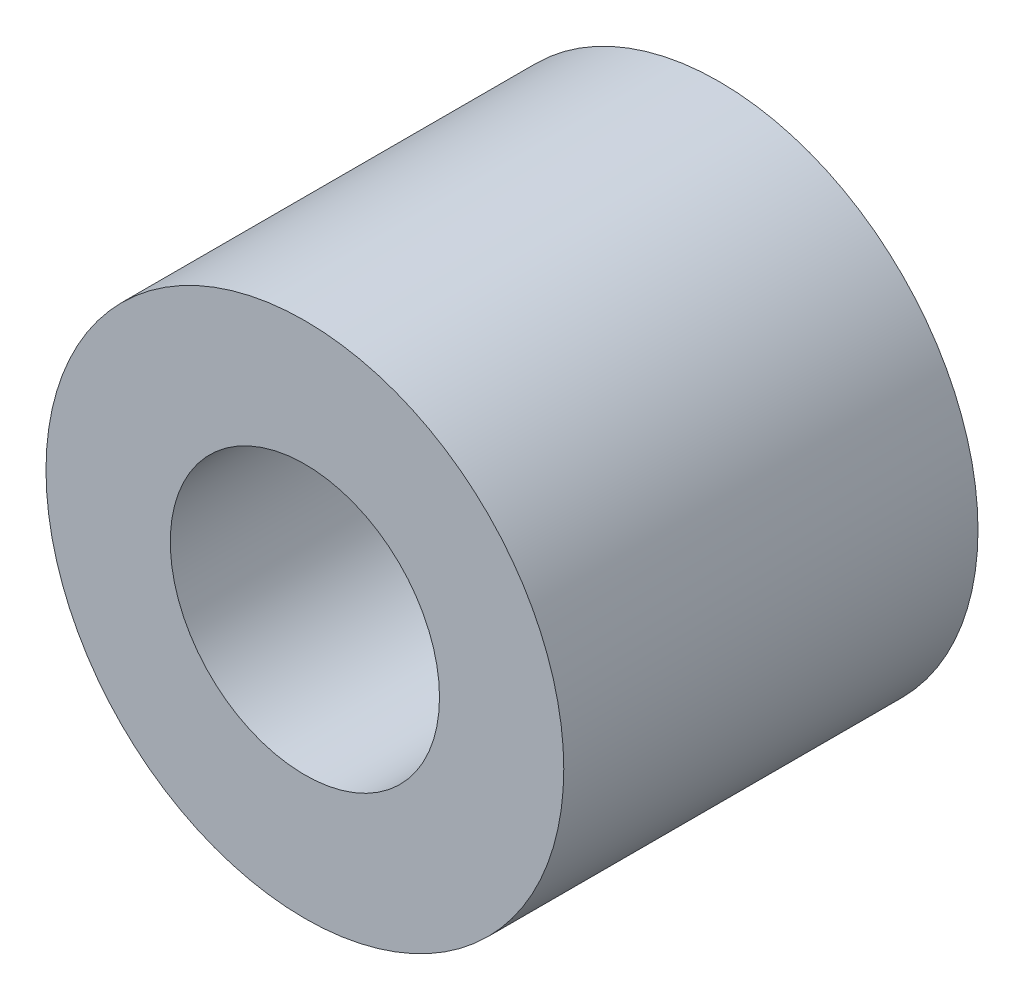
ISO-10303-21;
HEADER;
FILE_DESCRIPTION(('STEP AP214'),'2;1');
FILE_NAME('part.step','',(''),(''),'','','');
FILE_SCHEMA(('AUTOMOTIVE_DESIGN { 1 0 10303 214 1 1 1 1 }'));
ENDSEC;
DATA;
#1=APPLICATION_CONTEXT('core data for automotive mechanical design processes');
#2=APPLICATION_PROTOCOL_DEFINITION('international standard','automotive_design',2000,#1);
#3=PRODUCT_CONTEXT('',#1,'mechanical');
#4=PRODUCT('Part','Part','',(#3));
#5=PRODUCT_RELATED_PRODUCT_CATEGORY('part','',(#4));
#6=PRODUCT_DEFINITION_FORMATION('','',#4);
#7=PRODUCT_DEFINITION_CONTEXT('part definition',#1,'design');
#8=PRODUCT_DEFINITION('design','',#6,#7);
#9=PRODUCT_DEFINITION_SHAPE('','',#8);
#10=(LENGTH_UNIT() NAMED_UNIT(*) SI_UNIT(.MILLI.,.METRE.));
#11=(NAMED_UNIT(*) PLANE_ANGLE_UNIT() SI_UNIT($,.RADIAN.));
#12=(NAMED_UNIT(*) SI_UNIT($,.STERADIAN.) SOLID_ANGLE_UNIT());
#13=UNCERTAINTY_MEASURE_WITH_UNIT(LENGTH_MEASURE(1.E-05),#10,'distance_accuracy_value','');
#14=(GEOMETRIC_REPRESENTATION_CONTEXT(3) GLOBAL_UNCERTAINTY_ASSIGNED_CONTEXT((#13)) GLOBAL_UNIT_ASSIGNED_CONTEXT((#10,
#11,#12)) REPRESENTATION_CONTEXT('',''));
#15=CARTESIAN_POINT('',(0.,0.,0.));
#16=DIRECTION('',(0.,0.,1.));
#17=DIRECTION('',(1.,0.,0.));
#18=AXIS2_PLACEMENT_3D('',#15,#16,#17);
#19=CARTESIAN_POINT('',(13.,0.,15.));
#20=DIRECTION('',(0.,0.,-1.));
#21=DIRECTION('',(-1.,0.,0.));
#22=AXIS2_PLACEMENT_3D('',#19,#20,#21);
#23=PLANE('',#22);
#24=CARTESIAN_POINT('',(0.,0.,15.));
#25=DIRECTION('',(0.,0.,1.));
#26=DIRECTION('',(1.,0.,0.));
#27=AXIS2_PLACEMENT_3D('',#24,#25,#26);
#28=CIRCLE('',#27,9.);
#29=CARTESIAN_POINT('',(9.,0.,15.));
#30=VERTEX_POINT('',#29);
#31=EDGE_CURVE('E8',#30,#30,#28,.T.);
#32=ORIENTED_EDGE('',*,*,#31,.F.);
#33=EDGE_LOOP('',(#32));
#34=FACE_BOUND('',#33,.T.);
#35=CARTESIAN_POINT('',(0.,0.,15.));
#36=DIRECTION('',(0.,0.,1.));
#37=DIRECTION('',(1.,0.,0.));
#38=AXIS2_PLACEMENT_3D('',#35,#36,#37);
#39=CIRCLE('',#38,13.);
#40=CARTESIAN_POINT('',(13.,0.,15.));
#41=VERTEX_POINT('',#40);
#42=EDGE_CURVE('E34',#41,#41,#39,.T.);
#43=ORIENTED_EDGE('',*,*,#42,.T.);
#44=EDGE_LOOP('',(#43));
#45=FACE_BOUND('',#44,.T.);
#46=ADVANCED_FACE('F12',(#34,#45),#23,.F.);
#47=CARTESIAN_POINT('',(0.,0.,40.));
#48=DIRECTION('',(0.,0.,1.));
#49=DIRECTION('',(1.,0.,0.));
#50=AXIS2_PLACEMENT_3D('',#47,#48,#49);
#51=CYLINDRICAL_SURFACE('',#50,9.);
#52=CARTESIAN_POINT('',(0.,0.,0.));
#53=DIRECTION('',(0.,0.,1.));
#54=DIRECTION('',(1.,0.,0.));
#55=AXIS2_PLACEMENT_3D('',#52,#53,#54);
#56=CIRCLE('',#55,9.);
#57=CARTESIAN_POINT('',(9.,0.,0.));
#58=VERTEX_POINT('',#57);
#59=EDGE_CURVE('E18',#58,#58,#56,.T.);
#60=ORIENTED_EDGE('',*,*,#59,.F.);
#61=EDGE_LOOP('',(#60));
#62=FACE_BOUND('',#61,.T.);
#63=ORIENTED_EDGE('',*,*,#31,.T.);
#64=EDGE_LOOP('',(#63));
#65=FACE_BOUND('',#64,.T.);
#66=ADVANCED_FACE('F59',(#62,#65),#51,.F.);
#67=CARTESIAN_POINT('',(9.,0.,0.));
#68=DIRECTION('',(0.,0.,1.));
#69=DIRECTION('',(1.,0.,0.));
#70=AXIS2_PLACEMENT_3D('',#67,#68,#69);
#71=PLANE('',#70);
#72=CARTESIAN_POINT('',(0.,0.,0.));
#73=DIRECTION('',(0.,0.,1.));
#74=DIRECTION('',(1.,0.,0.));
#75=AXIS2_PLACEMENT_3D('',#72,#73,#74);
#76=CIRCLE('',#75,25.);
#77=CARTESIAN_POINT('',(25.,0.,0.));
#78=VERTEX_POINT('',#77);
#79=EDGE_CURVE('E22',#78,#78,#76,.T.);
#80=ORIENTED_EDGE('',*,*,#79,.F.);
#81=EDGE_LOOP('',(#80));
#82=FACE_BOUND('',#81,.T.);
#83=ORIENTED_EDGE('',*,*,#59,.T.);
#84=EDGE_LOOP('',(#83));
#85=FACE_BOUND('',#84,.T.);
#86=ADVANCED_FACE('F54',(#82,#85),#71,.F.);
#87=CARTESIAN_POINT('',(0.,0.,40.));
#88=DIRECTION('',(0.,0.,1.));
#89=DIRECTION('',(1.,0.,0.));
#90=AXIS2_PLACEMENT_3D('',#87,#88,#89);
#91=CYLINDRICAL_SURFACE('',#90,25.);
#92=CARTESIAN_POINT('',(0.,0.,40.));
#93=DIRECTION('',(0.,0.,1.));
#94=DIRECTION('',(1.,0.,0.));
#95=AXIS2_PLACEMENT_3D('',#92,#93,#94);
#96=CIRCLE('',#95,25.);
#97=CARTESIAN_POINT('',(25.,0.,40.));
#98=VERTEX_POINT('',#97);
#99=EDGE_CURVE('E26',#98,#98,#96,.T.);
#100=ORIENTED_EDGE('',*,*,#99,.F.);
#101=EDGE_LOOP('',(#100));
#102=FACE_BOUND('',#101,.T.);
#103=ORIENTED_EDGE('',*,*,#79,.T.);
#104=EDGE_LOOP('',(#103));
#105=FACE_BOUND('',#104,.T.);
#106=ADVANCED_FACE('F48',(#102,#105),#91,.T.);
#107=CARTESIAN_POINT('',(25.,0.,40.));
#108=DIRECTION('',(0.,0.,-1.));
#109=DIRECTION('',(-1.,0.,0.));
#110=AXIS2_PLACEMENT_3D('',#107,#108,#109);
#111=PLANE('',#110);
#112=CARTESIAN_POINT('',(0.,0.,40.));
#113=DIRECTION('',(0.,0.,1.));
#114=DIRECTION('',(1.,0.,0.));
#115=AXIS2_PLACEMENT_3D('',#112,#113,#114);
#116=CIRCLE('',#115,13.);
#117=CARTESIAN_POINT('',(13.,0.,40.));
#118=VERTEX_POINT('',#117);
#119=EDGE_CURVE('E31',#118,#118,#116,.T.);
#120=ORIENTED_EDGE('',*,*,#119,.F.);
#121=EDGE_LOOP('',(#120));
#122=FACE_BOUND('',#121,.T.);
#123=ORIENTED_EDGE('',*,*,#99,.T.);
#124=EDGE_LOOP('',(#123));
#125=FACE_BOUND('',#124,.T.);
#126=ADVANCED_FACE('F42',(#122,#125),#111,.F.);
#127=CARTESIAN_POINT('',(0.,0.,40.));
#128=DIRECTION('',(0.,0.,1.));
#129=DIRECTION('',(1.,0.,0.));
#130=AXIS2_PLACEMENT_3D('',#127,#128,#129);
#131=CYLINDRICAL_SURFACE('',#130,13.);
#132=ORIENTED_EDGE('',*,*,#42,.F.);
#133=EDGE_LOOP('',(#132));
#134=FACE_BOUND('',#133,.T.);
#135=ORIENTED_EDGE('',*,*,#119,.T.);
#136=EDGE_LOOP('',(#135));
#137=FACE_BOUND('',#136,.T.);
#138=ADVANCED_FACE('F39',(#134,#137),#131,.F.);
#139=CLOSED_SHELL('',(#46,#66,#86,#106,#126,#138));
#140=MANIFOLD_SOLID_BREP('B1',#139);
#141=ADVANCED_BREP_SHAPE_REPRESENTATION('',(#18,#140),#14);
#142=SHAPE_DEFINITION_REPRESENTATION(#9,#141);
ENDSEC;
END-ISO-10303-21;
